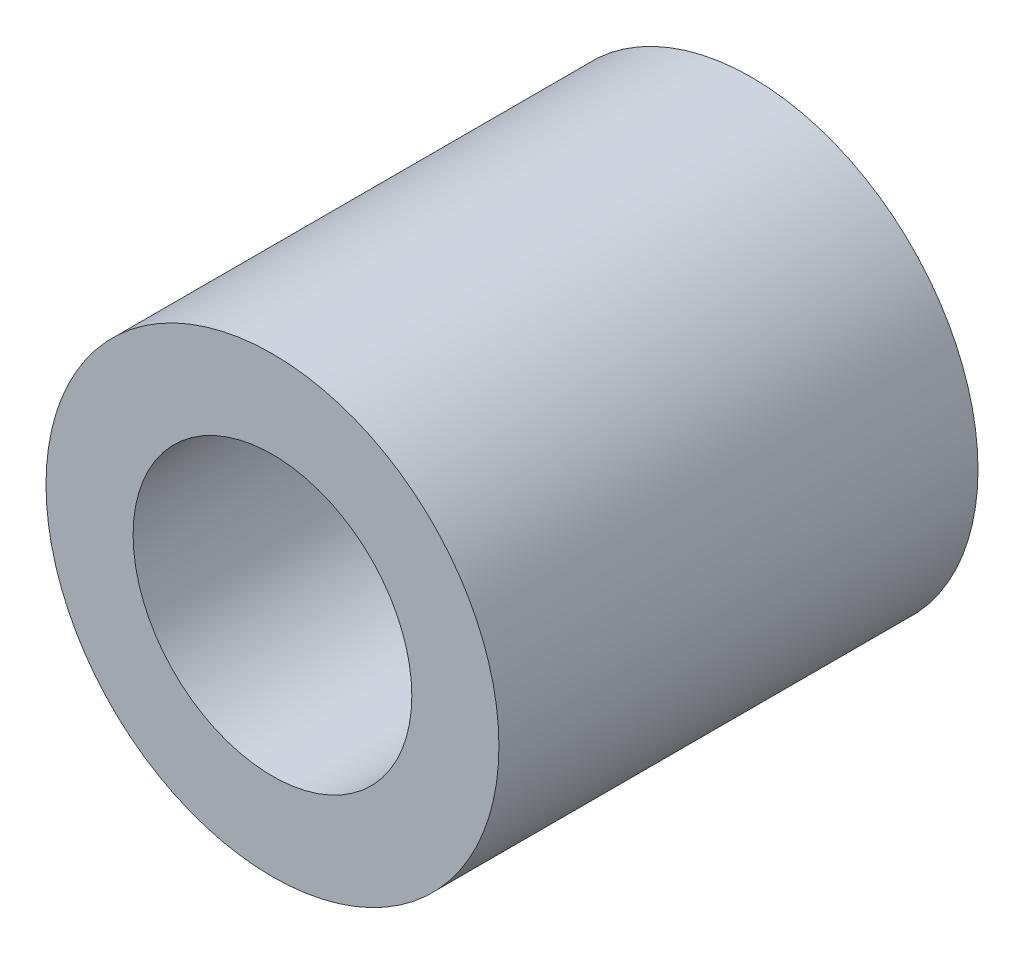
ISO-10303-21;
HEADER;
FILE_DESCRIPTION(('STEP AP214'),'2;1');
FILE_NAME('part.step','',(''),(''),'','','');
FILE_SCHEMA(('AUTOMOTIVE_DESIGN { 1 0 10303 214 1 1 1 1 }'));
ENDSEC;
DATA;
#1=APPLICATION_CONTEXT('core data for automotive mechanical design processes');
#2=APPLICATION_PROTOCOL_DEFINITION('international standard','automotive_design',2000,#1);
#3=PRODUCT_CONTEXT('',#1,'mechanical');
#4=PRODUCT('Part','Part','',(#3));
#5=PRODUCT_RELATED_PRODUCT_CATEGORY('part','',(#4));
#6=PRODUCT_DEFINITION_FORMATION('','',#4);
#7=PRODUCT_DEFINITION_CONTEXT('part definition',#1,'design');
#8=PRODUCT_DEFINITION('design','',#6,#7);
#9=PRODUCT_DEFINITION_SHAPE('','',#8);
#10=(LENGTH_UNIT() NAMED_UNIT(*) SI_UNIT(.MILLI.,.METRE.));
#11=(NAMED_UNIT(*) PLANE_ANGLE_UNIT() SI_UNIT($,.RADIAN.));
#12=(NAMED_UNIT(*) SI_UNIT($,.STERADIAN.) SOLID_ANGLE_UNIT());
#13=UNCERTAINTY_MEASURE_WITH_UNIT(LENGTH_MEASURE(1.E-05),#10,'distance_accuracy_value','');
#14=(GEOMETRIC_REPRESENTATION_CONTEXT(3) GLOBAL_UNCERTAINTY_ASSIGNED_CONTEXT((#13)) GLOBAL_UNIT_ASSIGNED_CONTEXT((#10,
#11,#12)) REPRESENTATION_CONTEXT('',''));
#15=CARTESIAN_POINT('',(0.,0.,0.));
#16=DIRECTION('',(0.,0.,1.));
#17=DIRECTION('',(1.,0.,0.));
#18=AXIS2_PLACEMENT_3D('',#15,#16,#17);
#19=CARTESIAN_POINT('',(468.467875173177,-125.000000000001,-69.269552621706));
#20=DIRECTION('',(0.,0.,1.));
#21=DIRECTION('',(1.,0.,0.));
#22=AXIS2_PLACEMENT_3D('',#19,#20,#21);
#23=CYLINDRICAL_SURFACE('',#22,13.0000000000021);
#24=CARTESIAN_POINT('',(468.467875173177,-125.000000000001,-32.4999999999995));
#25=DIRECTION('',(0.,0.,1.));
#26=DIRECTION('',(1.,0.,0.));
#27=AXIS2_PLACEMENT_3D('',#24,#25,#26);
#28=CIRCLE('',#27,13.0000000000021);
#29=CARTESIAN_POINT('',(481.467875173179,-125.000000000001,-32.4999999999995));
#30=VERTEX_POINT('',#29);
#31=EDGE_CURVE('E10',#30,#30,#28,.F.);
#32=ORIENTED_EDGE('',*,*,#31,.F.);
#33=EDGE_LOOP('',(#32));
#34=FACE_BOUND('',#33,.T.);
#35=CARTESIAN_POINT('',(468.467875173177,-125.000000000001,-5.00000000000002));
#36=DIRECTION('',(0.,0.,1.));
#37=DIRECTION('',(1.,0.,0.));
#38=AXIS2_PLACEMENT_3D('',#35,#36,#37);
#39=CIRCLE('',#38,13.0000000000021);
#40=CARTESIAN_POINT('',(481.467875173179,-125.000000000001,-5.00000000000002));
#41=VERTEX_POINT('',#40);
#42=EDGE_CURVE('E27',#41,#41,#39,.T.);
#43=ORIENTED_EDGE('',*,*,#42,.F.);
#44=EDGE_LOOP('',(#43));
#45=FACE_BOUND('',#44,.T.);
#46=ADVANCED_FACE('F24',(#34,#45),#23,.T.);
#47=CARTESIAN_POINT('',(468.467875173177,-125.000000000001,-5.00000000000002));
#48=DIRECTION('',(0.,0.,1.));
#49=DIRECTION('',(1.,0.,0.));
#50=AXIS2_PLACEMENT_3D('',#47,#48,#49);
#51=PLANE('',#50);
#52=CARTESIAN_POINT('',(468.467875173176,-125.,-5.00000000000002));
#53=DIRECTION('',(0.,0.,1.));
#54=DIRECTION('',(1.,0.,0.));
#55=AXIS2_PLACEMENT_3D('',#52,#53,#54);
#56=CIRCLE('',#55,8.00000000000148);
#57=CARTESIAN_POINT('',(476.467875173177,-125.,-5.00000000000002));
#58=VERTEX_POINT('',#57);
#59=EDGE_CURVE('E37',#58,#58,#56,.T.);
#60=ORIENTED_EDGE('',*,*,#59,.F.);
#61=EDGE_LOOP('',(#60));
#62=FACE_BOUND('',#61,.T.);
#63=ORIENTED_EDGE('',*,*,#42,.T.);
#64=EDGE_LOOP('',(#63));
#65=FACE_BOUND('',#64,.T.);
#66=ADVANCED_FACE('F44',(#62,#65),#51,.T.);
#67=CARTESIAN_POINT('',(468.467875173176,-125.,-69.269552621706));
#68=DIRECTION('',(0.,0.,1.));
#69=DIRECTION('',(1.,0.,0.));
#70=AXIS2_PLACEMENT_3D('',#67,#68,#69);
#71=CYLINDRICAL_SURFACE('',#70,8.00000000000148);
#72=CARTESIAN_POINT('',(468.467875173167,-124.999999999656,-32.4999999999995));
#73=DIRECTION('',(0.,0.,1.));
#74=DIRECTION('',(-0.807977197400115,-0.589213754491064,0.));
#75=AXIS2_PLACEMENT_3D('',#72,#73,#74);
#76=CIRCLE('',#75,7.99999999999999);
#77=CARTESIAN_POINT('',(462.004057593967,-129.713710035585,-32.4999999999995));
#78=VERTEX_POINT('',#77);
#79=EDGE_CURVE('E31',#78,#78,#76,.T.);
#80=ORIENTED_EDGE('',*,*,#79,.F.);
#81=EDGE_LOOP('',(#80));
#82=FACE_BOUND('',#81,.T.);
#83=ORIENTED_EDGE('',*,*,#59,.T.);
#84=EDGE_LOOP('',(#83));
#85=FACE_BOUND('',#84,.T.);
#86=ADVANCED_FACE('F51',(#82,#85),#71,.F.);
#87=CARTESIAN_POINT('',(641.567251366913,-0.447555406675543,-32.4999999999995));
#88=DIRECTION('',(0.,0.,1.));
#89=DIRECTION('',(-0.807977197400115,-0.589213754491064,0.));
#90=AXIS2_PLACEMENT_3D('',#87,#88,#89);
#91=PLANE('',#90);
#92=ORIENTED_EDGE('',*,*,#31,.T.);
#93=EDGE_LOOP('',(#92));
#94=FACE_BOUND('',#93,.T.);
#95=ORIENTED_EDGE('',*,*,#79,.T.);
#96=EDGE_LOOP('',(#95));
#97=FACE_BOUND('',#96,.T.);
#98=ADVANCED_FACE('F56',(#94,#97),#91,.F.);
#99=CLOSED_SHELL('',(#46,#66,#86,#98));
#100=MANIFOLD_SOLID_BREP('B2',#99);
#101=ADVANCED_BREP_SHAPE_REPRESENTATION('',(#18,#100),#14);
#102=SHAPE_DEFINITION_REPRESENTATION(#9,#101);
ENDSEC;
END-ISO-10303-21;
